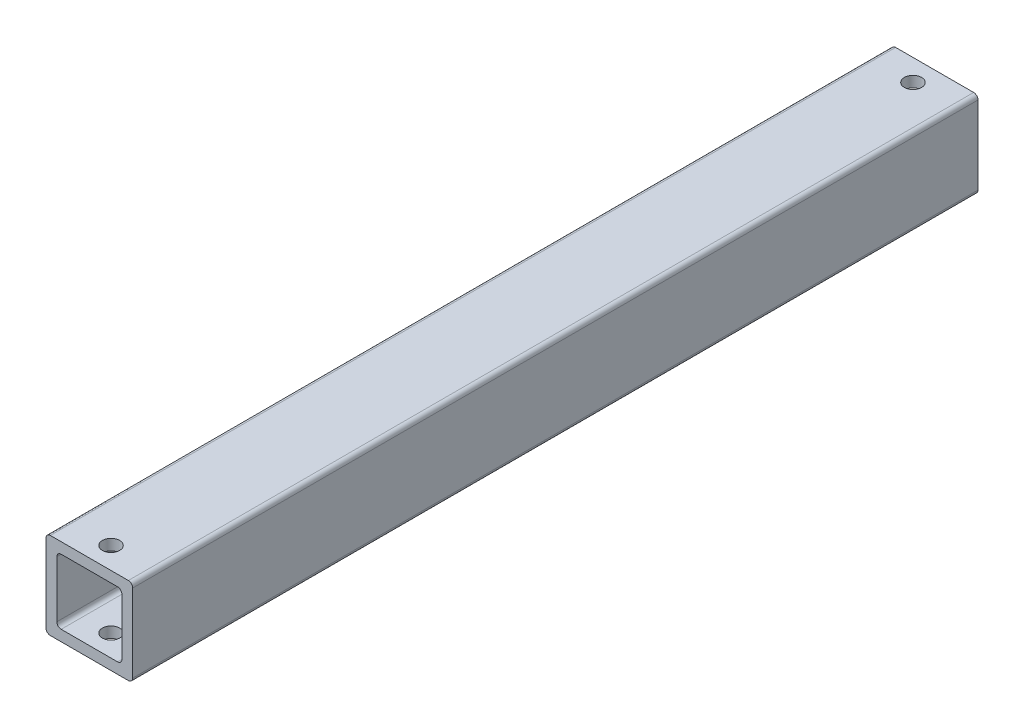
ISO-10303-21;
HEADER;
FILE_DESCRIPTION(('STEP AP214'),'2;1');
FILE_NAME('part.step','',(''),(''),'','','');
FILE_SCHEMA(('AUTOMOTIVE_DESIGN { 1 0 10303 214 1 1 1 1 }'));
ENDSEC;
DATA;
#1=APPLICATION_CONTEXT('core data for automotive mechanical design processes');
#2=APPLICATION_PROTOCOL_DEFINITION('international standard','automotive_design',2000,#1);
#3=PRODUCT_CONTEXT('',#1,'mechanical');
#4=PRODUCT('Part','Part','',(#3));
#5=PRODUCT_RELATED_PRODUCT_CATEGORY('part','',(#4));
#6=PRODUCT_DEFINITION_FORMATION('','',#4);
#7=PRODUCT_DEFINITION_CONTEXT('part definition',#1,'design');
#8=PRODUCT_DEFINITION('design','',#6,#7);
#9=PRODUCT_DEFINITION_SHAPE('','',#8);
#10=(LENGTH_UNIT() NAMED_UNIT(*) SI_UNIT(.MILLI.,.METRE.));
#11=(NAMED_UNIT(*) PLANE_ANGLE_UNIT() SI_UNIT($,.RADIAN.));
#12=(NAMED_UNIT(*) SI_UNIT($,.STERADIAN.) SOLID_ANGLE_UNIT());
#13=UNCERTAINTY_MEASURE_WITH_UNIT(LENGTH_MEASURE(1.E-05),#10,'distance_accuracy_value','');
#14=(GEOMETRIC_REPRESENTATION_CONTEXT(3) GLOBAL_UNCERTAINTY_ASSIGNED_CONTEXT((#13)) GLOBAL_UNIT_ASSIGNED_CONTEXT((#10,
#11,#12)) REPRESENTATION_CONTEXT('',''));
#15=CARTESIAN_POINT('',(0.,0.,0.));
#16=DIRECTION('',(0.,0.,1.));
#17=DIRECTION('',(1.,0.,0.));
#18=AXIS2_PLACEMENT_3D('',#15,#16,#17);
#19=CARTESIAN_POINT('',(-22.86,22.86,685.8));
#20=DIRECTION('',(0.,0.,-1.));
#21=DIRECTION('',(-1.,0.,0.));
#22=AXIS2_PLACEMENT_3D('',#19,#20,#21);
#23=CYLINDRICAL_SURFACE('',#22,2.54);
#24=CARTESIAN_POINT('',(-22.86,22.86,247.65));
#25=DIRECTION('',(0.,0.,1.));
#26=DIRECTION('',(1.,0.,0.));
#27=AXIS2_PLACEMENT_3D('',#24,#25,#26);
#28=CIRCLE('',#27,2.54);
#29=CARTESIAN_POINT('',(-22.86,25.4,247.65));
#30=VERTEX_POINT('',#29);
#31=CARTESIAN_POINT('',(-25.4,22.86,247.65));
#32=VERTEX_POINT('',#31);
#33=EDGE_CURVE('E316',#30,#32,#28,.T.);
#34=ORIENTED_EDGE('',*,*,#33,.F.);
#35=DIRECTION('',(0.,0.,-1.));
#36=VECTOR('',#35,1.);
#37=CARTESIAN_POINT('',(-22.86,25.4,685.8));
#38=LINE('',#37,#36);
#39=CARTESIAN_POINT('',(-22.86,25.4,-247.65));
#40=VERTEX_POINT('',#39);
#41=EDGE_CURVE('E176',#30,#40,#38,.T.);
#42=ORIENTED_EDGE('',*,*,#41,.T.);
#43=CARTESIAN_POINT('',(-22.86,22.86,-247.65));
#44=DIRECTION('',(0.,0.,-1.));
#45=DIRECTION('',(-1.,0.,0.));
#46=AXIS2_PLACEMENT_3D('',#43,#44,#45);
#47=CIRCLE('',#46,2.54);
#48=CARTESIAN_POINT('',(-25.4,22.86,-247.65));
#49=VERTEX_POINT('',#48);
#50=EDGE_CURVE('E211',#49,#40,#47,.T.);
#51=ORIENTED_EDGE('',*,*,#50,.F.);
#52=DIRECTION('',(0.,0.,-1.));
#53=VECTOR('',#52,1.);
#54=CARTESIAN_POINT('',(-25.4,22.86,685.8));
#55=LINE('',#54,#53);
#56=EDGE_CURVE('E190',#32,#49,#55,.T.);
#57=ORIENTED_EDGE('',*,*,#56,.F.);
#58=EDGE_LOOP('',(#34,#42,#51,#57));
#59=FACE_BOUND('',#58,.T.);
#60=ADVANCED_FACE('F32',(#59),#23,.T.);
#61=CARTESIAN_POINT('',(-25.4,-22.86,685.8));
#62=DIRECTION('',(1.,0.,0.));
#63=DIRECTION('',(0.,0.,-1.));
#64=AXIS2_PLACEMENT_3D('',#61,#62,#63);
#65=PLANE('',#64);
#66=DIRECTION('',(0.,-1.,0.));
#67=VECTOR('',#66,1.);
#68=CARTESIAN_POINT('',(-25.4,-22.86,247.65));
#69=LINE('',#68,#67);
#70=CARTESIAN_POINT('',(-25.4,-22.86,247.65));
#71=VERTEX_POINT('',#70);
#72=EDGE_CURVE('E314',#32,#71,#69,.T.);
#73=ORIENTED_EDGE('',*,*,#72,.F.);
#74=ORIENTED_EDGE('',*,*,#56,.T.);
#75=DIRECTION('',(0.,1.,0.));
#76=VECTOR('',#75,1.);
#77=CARTESIAN_POINT('',(-25.4,-22.86,-247.65));
#78=LINE('',#77,#76);
#79=CARTESIAN_POINT('',(-25.4,-22.86,-247.65));
#80=VERTEX_POINT('',#79);
#81=EDGE_CURVE('E270',#80,#49,#78,.T.);
#82=ORIENTED_EDGE('',*,*,#81,.F.);
#83=DIRECTION('',(0.,0.,-1.));
#84=VECTOR('',#83,1.);
#85=CARTESIAN_POINT('',(-25.4,-22.86,685.8));
#86=LINE('',#85,#84);
#87=EDGE_CURVE('E188',#71,#80,#86,.T.);
#88=ORIENTED_EDGE('',*,*,#87,.F.);
#89=EDGE_LOOP('',(#73,#74,#82,#88));
#90=FACE_BOUND('',#89,.T.);
#91=ADVANCED_FACE('F313',(#90),#65,.F.);
#92=CARTESIAN_POINT('',(-22.86,-22.86,685.8));
#93=DIRECTION('',(0.,0.,-1.));
#94=DIRECTION('',(-1.,0.,0.));
#95=AXIS2_PLACEMENT_3D('',#92,#93,#94);
#96=CYLINDRICAL_SURFACE('',#95,2.54);
#97=CARTESIAN_POINT('',(-22.86,-22.86,247.65));
#98=DIRECTION('',(0.,0.,1.));
#99=DIRECTION('',(1.,0.,0.));
#100=AXIS2_PLACEMENT_3D('',#97,#98,#99);
#101=CIRCLE('',#100,2.54);
#102=CARTESIAN_POINT('',(-22.86,-25.4,247.65));
#103=VERTEX_POINT('',#102);
#104=EDGE_CURVE('E309',#71,#103,#101,.T.);
#105=ORIENTED_EDGE('',*,*,#104,.F.);
#106=ORIENTED_EDGE('',*,*,#87,.T.);
#107=CARTESIAN_POINT('',(-22.86,-22.86,-247.65));
#108=DIRECTION('',(0.,0.,-1.));
#109=DIRECTION('',(-1.,0.,0.));
#110=AXIS2_PLACEMENT_3D('',#107,#108,#109);
#111=CIRCLE('',#110,2.54);
#112=CARTESIAN_POINT('',(-22.86,-25.4,-247.65));
#113=VERTEX_POINT('',#112);
#114=EDGE_CURVE('E267',#113,#80,#111,.T.);
#115=ORIENTED_EDGE('',*,*,#114,.F.);
#116=DIRECTION('',(0.,0.,-1.));
#117=VECTOR('',#116,1.);
#118=CARTESIAN_POINT('',(-22.86,-25.4,685.8));
#119=LINE('',#118,#117);
#120=EDGE_CURVE('E186',#103,#113,#119,.T.);
#121=ORIENTED_EDGE('',*,*,#120,.F.);
#122=EDGE_LOOP('',(#105,#106,#115,#121));
#123=FACE_BOUND('',#122,.T.);
#124=ADVANCED_FACE('F308',(#123),#96,.T.);
#125=CARTESIAN_POINT('',(-22.86,-25.4,685.8));
#126=DIRECTION('',(0.,1.,0.));
#127=DIRECTION('',(0.,0.,1.));
#128=AXIS2_PLACEMENT_3D('',#125,#126,#127);
#129=PLANE('',#128);
#130=CARTESIAN_POINT('',(0.,-25.4,-234.95));
#131=DIRECTION('',(0.,1.,0.));
#132=DIRECTION('',(-1.,0.,0.));
#133=AXIS2_PLACEMENT_3D('',#130,#131,#132);
#134=CIRCLE('',#133,5.07999999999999);
#135=CARTESIAN_POINT('',(-5.07999999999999,-25.4,-234.95));
#136=VERTEX_POINT('',#135);
#137=EDGE_CURVE('E199',#136,#136,#134,.T.);
#138=ORIENTED_EDGE('',*,*,#137,.T.);
#139=EDGE_LOOP('',(#138));
#140=FACE_BOUND('',#139,.T.);
#141=CARTESIAN_POINT('',(0.,-25.4,234.95));
#142=DIRECTION('',(0.,1.,0.));
#143=DIRECTION('',(-1.,0.,0.));
#144=AXIS2_PLACEMENT_3D('',#141,#142,#143);
#145=CIRCLE('',#144,5.07999999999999);
#146=CARTESIAN_POINT('',(-5.07999999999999,-25.4,234.95));
#147=VERTEX_POINT('',#146);
#148=EDGE_CURVE('E195',#147,#147,#145,.T.);
#149=ORIENTED_EDGE('',*,*,#148,.T.);
#150=EDGE_LOOP('',(#149));
#151=FACE_BOUND('',#150,.T.);
#152=DIRECTION('',(1.,0.,0.));
#153=VECTOR('',#152,1.);
#154=CARTESIAN_POINT('',(-22.86,-25.4,247.65));
#155=LINE('',#154,#153);
#156=CARTESIAN_POINT('',(22.86,-25.4,247.65));
#157=VERTEX_POINT('',#156);
#158=EDGE_CURVE('E305',#103,#157,#155,.T.);
#159=ORIENTED_EDGE('',*,*,#158,.F.);
#160=ORIENTED_EDGE('',*,*,#120,.T.);
#161=DIRECTION('',(-1.,0.,0.));
#162=VECTOR('',#161,1.);
#163=CARTESIAN_POINT('',(-22.86,-25.4,-247.65));
#164=LINE('',#163,#162);
#165=CARTESIAN_POINT('',(22.86,-25.4,-247.65));
#166=VERTEX_POINT('',#165);
#167=EDGE_CURVE('E264',#166,#113,#164,.T.);
#168=ORIENTED_EDGE('',*,*,#167,.F.);
#169=DIRECTION('',(0.,0.,-1.));
#170=VECTOR('',#169,1.);
#171=CARTESIAN_POINT('',(22.86,-25.4,685.8));
#172=LINE('',#171,#170);
#173=EDGE_CURVE('E184',#157,#166,#172,.T.);
#174=ORIENTED_EDGE('',*,*,#173,.F.);
#175=EDGE_LOOP('',(#159,#160,#168,#174));
#176=FACE_BOUND('',#175,.T.);
#177=ADVANCED_FACE('F303',(#140,#151,#176),#129,.F.);
#178=CARTESIAN_POINT('',(22.86,-22.86,685.8));
#179=DIRECTION('',(0.,0.,-1.));
#180=DIRECTION('',(-1.,0.,0.));
#181=AXIS2_PLACEMENT_3D('',#178,#179,#180);
#182=CYLINDRICAL_SURFACE('',#181,2.54);
#183=CARTESIAN_POINT('',(22.86,-22.86,247.65));
#184=DIRECTION('',(0.,0.,1.));
#185=DIRECTION('',(1.,0.,0.));
#186=AXIS2_PLACEMENT_3D('',#183,#184,#185);
#187=CIRCLE('',#186,2.54);
#188=CARTESIAN_POINT('',(25.4,-22.86,247.65));
#189=VERTEX_POINT('',#188);
#190=EDGE_CURVE('E297',#157,#189,#187,.T.);
#191=ORIENTED_EDGE('',*,*,#190,.F.);
#192=ORIENTED_EDGE('',*,*,#173,.T.);
#193=CARTESIAN_POINT('',(22.86,-22.86,-247.65));
#194=DIRECTION('',(0.,0.,-1.));
#195=DIRECTION('',(-1.,0.,0.));
#196=AXIS2_PLACEMENT_3D('',#193,#194,#195);
#197=CIRCLE('',#196,2.54);
#198=CARTESIAN_POINT('',(25.4,-22.86,-247.65));
#199=VERTEX_POINT('',#198);
#200=EDGE_CURVE('E261',#199,#166,#197,.T.);
#201=ORIENTED_EDGE('',*,*,#200,.F.);
#202=DIRECTION('',(0.,0.,-1.));
#203=VECTOR('',#202,1.);
#204=CARTESIAN_POINT('',(25.4,-22.86,685.8));
#205=LINE('',#204,#203);
#206=EDGE_CURVE('E182',#189,#199,#205,.T.);
#207=ORIENTED_EDGE('',*,*,#206,.F.);
#208=EDGE_LOOP('',(#191,#192,#201,#207));
#209=FACE_BOUND('',#208,.T.);
#210=ADVANCED_FACE('F296',(#209),#182,.T.);
#211=CARTESIAN_POINT('',(25.4,-22.86,685.8));
#212=DIRECTION('',(-1.,0.,0.));
#213=DIRECTION('',(0.,0.,1.));
#214=AXIS2_PLACEMENT_3D('',#211,#212,#213);
#215=PLANE('',#214);
#216=DIRECTION('',(0.,1.,0.));
#217=VECTOR('',#216,1.);
#218=CARTESIAN_POINT('',(25.4,-22.86,247.65));
#219=LINE('',#218,#217);
#220=CARTESIAN_POINT('',(25.4,22.86,247.65));
#221=VERTEX_POINT('',#220);
#222=EDGE_CURVE('E293',#189,#221,#219,.T.);
#223=ORIENTED_EDGE('',*,*,#222,.F.);
#224=ORIENTED_EDGE('',*,*,#206,.T.);
#225=DIRECTION('',(0.,-1.,0.));
#226=VECTOR('',#225,1.);
#227=CARTESIAN_POINT('',(25.4,-22.86,-247.65));
#228=LINE('',#227,#226);
#229=CARTESIAN_POINT('',(25.4,22.86,-247.65));
#230=VERTEX_POINT('',#229);
#231=EDGE_CURVE('E258',#230,#199,#228,.T.);
#232=ORIENTED_EDGE('',*,*,#231,.F.);
#233=DIRECTION('',(0.,0.,-1.));
#234=VECTOR('',#233,1.);
#235=CARTESIAN_POINT('',(25.4,22.86,685.8));
#236=LINE('',#235,#234);
#237=EDGE_CURVE('E180',#221,#230,#236,.T.);
#238=ORIENTED_EDGE('',*,*,#237,.F.);
#239=EDGE_LOOP('',(#223,#224,#232,#238));
#240=FACE_BOUND('',#239,.T.);
#241=ADVANCED_FACE('F291',(#240),#215,.F.);
#242=CARTESIAN_POINT('',(22.86,22.86,685.8));
#243=DIRECTION('',(0.,0.,-1.));
#244=DIRECTION('',(-1.,0.,0.));
#245=AXIS2_PLACEMENT_3D('',#242,#243,#244);
#246=CYLINDRICAL_SURFACE('',#245,2.54);
#247=CARTESIAN_POINT('',(22.86,22.86,247.65));
#248=DIRECTION('',(0.,0.,1.));
#249=DIRECTION('',(1.,0.,0.));
#250=AXIS2_PLACEMENT_3D('',#247,#248,#249);
#251=CIRCLE('',#250,2.54);
#252=CARTESIAN_POINT('',(22.86,25.4,247.65));
#253=VERTEX_POINT('',#252);
#254=EDGE_CURVE('E46',#221,#253,#251,.T.);
#255=ORIENTED_EDGE('',*,*,#254,.F.);
#256=ORIENTED_EDGE('',*,*,#237,.T.);
#257=CARTESIAN_POINT('',(22.86,22.86,-247.65));
#258=DIRECTION('',(0.,0.,-1.));
#259=DIRECTION('',(-1.,0.,0.));
#260=AXIS2_PLACEMENT_3D('',#257,#258,#259);
#261=CIRCLE('',#260,2.54);
#262=CARTESIAN_POINT('',(22.86,25.4,-247.65));
#263=VERTEX_POINT('',#262);
#264=EDGE_CURVE('E250',#263,#230,#261,.T.);
#265=ORIENTED_EDGE('',*,*,#264,.F.);
#266=DIRECTION('',(0.,0.,-1.));
#267=VECTOR('',#266,1.);
#268=CARTESIAN_POINT('',(22.86,25.4,685.8));
#269=LINE('',#268,#267);
#270=EDGE_CURVE('E178',#253,#263,#269,.T.);
#271=ORIENTED_EDGE('',*,*,#270,.F.);
#272=EDGE_LOOP('',(#255,#256,#265,#271));
#273=FACE_BOUND('',#272,.T.);
#274=ADVANCED_FACE('F285',(#273),#246,.T.);
#275=CARTESIAN_POINT('',(-22.86,25.4,685.8));
#276=DIRECTION('',(0.,-1.,0.));
#277=DIRECTION('',(1.,0.,0.));
#278=AXIS2_PLACEMENT_3D('',#275,#276,#277);
#279=PLANE('',#278);
#280=CARTESIAN_POINT('',(0.,25.4,-234.95));
#281=DIRECTION('',(0.,1.,0.));
#282=DIRECTION('',(-1.,0.,0.));
#283=AXIS2_PLACEMENT_3D('',#280,#281,#282);
#284=CIRCLE('',#283,5.07999999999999);
#285=CARTESIAN_POINT('',(-5.07999999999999,25.4,-234.95));
#286=VERTEX_POINT('',#285);
#287=EDGE_CURVE('E206',#286,#286,#284,.T.);
#288=ORIENTED_EDGE('',*,*,#287,.F.);
#289=EDGE_LOOP('',(#288));
#290=FACE_BOUND('',#289,.T.);
#291=CARTESIAN_POINT('',(0.,25.4,234.95));
#292=DIRECTION('',(0.,1.,0.));
#293=DIRECTION('',(-1.,0.,0.));
#294=AXIS2_PLACEMENT_3D('',#291,#292,#293);
#295=CIRCLE('',#294,5.07999999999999);
#296=CARTESIAN_POINT('',(-5.07999999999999,25.4,234.95));
#297=VERTEX_POINT('',#296);
#298=EDGE_CURVE('E203',#297,#297,#295,.T.);
#299=ORIENTED_EDGE('',*,*,#298,.F.);
#300=EDGE_LOOP('',(#299));
#301=FACE_BOUND('',#300,.T.);
#302=DIRECTION('',(-1.,0.,0.));
#303=VECTOR('',#302,1.);
#304=CARTESIAN_POINT('',(-22.86,25.4,247.65));
#305=LINE('',#304,#303);
#306=EDGE_CURVE('E283',#253,#30,#305,.T.);
#307=ORIENTED_EDGE('',*,*,#306,.F.);
#308=ORIENTED_EDGE('',*,*,#270,.T.);
#309=DIRECTION('',(1.,0.,0.));
#310=VECTOR('',#309,1.);
#311=CARTESIAN_POINT('',(-22.86,25.4,-247.65));
#312=LINE('',#311,#310);
#313=EDGE_CURVE('E247',#40,#263,#312,.T.);
#314=ORIENTED_EDGE('',*,*,#313,.F.);
#315=ORIENTED_EDGE('',*,*,#41,.F.);
#316=EDGE_LOOP('',(#307,#308,#314,#315));
#317=FACE_BOUND('',#316,.T.);
#318=ADVANCED_FACE('F281',(#290,#301,#317),#279,.F.);
#319=CARTESIAN_POINT('',(16.51,16.51,685.8));
#320=DIRECTION('',(0.,0.,-1.));
#321=DIRECTION('',(-1.,0.,0.));
#322=AXIS2_PLACEMENT_3D('',#319,#320,#321);
#323=CYLINDRICAL_SURFACE('',#322,2.54);
#324=DIRECTION('',(0.,0.,-1.));
#325=VECTOR('',#324,1.);
#326=CARTESIAN_POINT('',(19.05,16.51,685.8));
#327=LINE('',#326,#325);
#328=CARTESIAN_POINT('',(19.05,16.51,247.65));
#329=VERTEX_POINT('',#328);
#330=CARTESIAN_POINT('',(19.05,16.51,-247.65));
#331=VERTEX_POINT('',#330);
#332=EDGE_CURVE('E159',#329,#331,#327,.T.);
#333=ORIENTED_EDGE('',*,*,#332,.F.);
#334=CARTESIAN_POINT('',(16.51,16.51,247.65));
#335=DIRECTION('',(0.,0.,1.));
#336=DIRECTION('',(1.,0.,0.));
#337=AXIS2_PLACEMENT_3D('',#334,#335,#336);
#338=CIRCLE('',#337,2.54);
#339=CARTESIAN_POINT('',(16.51,19.05,247.65));
#340=VERTEX_POINT('',#339);
#341=EDGE_CURVE('E54',#329,#340,#338,.T.);
#342=ORIENTED_EDGE('',*,*,#341,.T.);
#343=DIRECTION('',(0.,0.,-1.));
#344=VECTOR('',#343,1.);
#345=CARTESIAN_POINT('',(16.51,19.05,685.8));
#346=LINE('',#345,#344);
#347=CARTESIAN_POINT('',(16.51,19.05,-247.65));
#348=VERTEX_POINT('',#347);
#349=EDGE_CURVE('E174',#340,#348,#346,.T.);
#350=ORIENTED_EDGE('',*,*,#349,.T.);
#351=CARTESIAN_POINT('',(16.51,16.51,-247.65));
#352=DIRECTION('',(0.,0.,-1.));
#353=DIRECTION('',(-1.,0.,0.));
#354=AXIS2_PLACEMENT_3D('',#351,#352,#353);
#355=CIRCLE('',#354,2.54);
#356=EDGE_CURVE('E241',#348,#331,#355,.T.);
#357=ORIENTED_EDGE('',*,*,#356,.T.);
#358=EDGE_LOOP('',(#333,#342,#350,#357));
#359=FACE_BOUND('',#358,.T.);
#360=ADVANCED_FACE('F228',(#359),#323,.F.);
#361=CARTESIAN_POINT('',(-16.51,19.05,685.8));
#362=DIRECTION('',(0.,-1.,0.));
#363=DIRECTION('',(0.,0.,-1.));
#364=AXIS2_PLACEMENT_3D('',#361,#362,#363);
#365=PLANE('',#364);
#366=CARTESIAN_POINT('',(0.,19.05,-234.95));
#367=DIRECTION('',(0.,-1.,0.));
#368=DIRECTION('',(0.,0.,-1.));
#369=AXIS2_PLACEMENT_3D('',#366,#367,#368);
#370=CIRCLE('',#369,5.07999999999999);
#371=CARTESIAN_POINT('',(0.,19.05,-240.03));
#372=VERTEX_POINT('',#371);
#373=EDGE_CURVE('E198',#372,#372,#370,.T.);
#374=ORIENTED_EDGE('',*,*,#373,.F.);
#375=EDGE_LOOP('',(#374));
#376=FACE_BOUND('',#375,.T.);
#377=CARTESIAN_POINT('',(0.,19.05,234.95));
#378=DIRECTION('',(0.,-1.,0.));
#379=DIRECTION('',(0.,0.,-1.));
#380=AXIS2_PLACEMENT_3D('',#377,#378,#379);
#381=CIRCLE('',#380,5.07999999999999);
#382=CARTESIAN_POINT('',(0.,19.05,229.87));
#383=VERTEX_POINT('',#382);
#384=EDGE_CURVE('E163',#383,#383,#381,.T.);
#385=ORIENTED_EDGE('',*,*,#384,.F.);
#386=EDGE_LOOP('',(#385));
#387=FACE_BOUND('',#386,.T.);
#388=ORIENTED_EDGE('',*,*,#349,.F.);
#389=DIRECTION('',(-1.,0.,0.));
#390=VECTOR('',#389,1.);
#391=CARTESIAN_POINT('',(-16.51,19.05,247.65));
#392=LINE('',#391,#390);
#393=CARTESIAN_POINT('',(-16.51,19.05,247.65));
#394=VERTEX_POINT('',#393);
#395=EDGE_CURVE('E234',#340,#394,#392,.T.);
#396=ORIENTED_EDGE('',*,*,#395,.T.);
#397=DIRECTION('',(0.,0.,-1.));
#398=VECTOR('',#397,1.);
#399=CARTESIAN_POINT('',(-16.51,19.05,685.8));
#400=LINE('',#399,#398);
#401=CARTESIAN_POINT('',(-16.51,19.05,-247.65));
#402=VERTEX_POINT('',#401);
#403=EDGE_CURVE('E172',#394,#402,#400,.T.);
#404=ORIENTED_EDGE('',*,*,#403,.T.);
#405=DIRECTION('',(1.,0.,0.));
#406=VECTOR('',#405,1.);
#407=CARTESIAN_POINT('',(-16.51,19.05,-247.65));
#408=LINE('',#407,#406);
#409=EDGE_CURVE('E237',#402,#348,#408,.T.);
#410=ORIENTED_EDGE('',*,*,#409,.T.);
#411=EDGE_LOOP('',(#388,#396,#404,#410));
#412=FACE_BOUND('',#411,.T.);
#413=ADVANCED_FACE('F224',(#376,#387,#412),#365,.T.);
#414=CARTESIAN_POINT('',(-16.51,16.51,685.8));
#415=DIRECTION('',(0.,0.,-1.));
#416=DIRECTION('',(-1.,0.,0.));
#417=AXIS2_PLACEMENT_3D('',#414,#415,#416);
#418=CYLINDRICAL_SURFACE('',#417,2.54);
#419=ORIENTED_EDGE('',*,*,#403,.F.);
#420=CARTESIAN_POINT('',(-16.51,16.51,247.65));
#421=DIRECTION('',(0.,0.,1.));
#422=DIRECTION('',(1.,0.,0.));
#423=AXIS2_PLACEMENT_3D('',#420,#421,#422);
#424=CIRCLE('',#423,2.54);
#425=CARTESIAN_POINT('',(-19.05,16.51,247.65));
#426=VERTEX_POINT('',#425);
#427=EDGE_CURVE('E353',#394,#426,#424,.T.);
#428=ORIENTED_EDGE('',*,*,#427,.T.);
#429=DIRECTION('',(0.,0.,-1.));
#430=VECTOR('',#429,1.);
#431=CARTESIAN_POINT('',(-19.05,16.51,685.8));
#432=LINE('',#431,#430);
#433=CARTESIAN_POINT('',(-19.05,16.51,-247.65));
#434=VERTEX_POINT('',#433);
#435=EDGE_CURVE('E170',#426,#434,#432,.T.);
#436=ORIENTED_EDGE('',*,*,#435,.T.);
#437=CARTESIAN_POINT('',(-16.51,16.51,-247.65));
#438=DIRECTION('',(0.,0.,-1.));
#439=DIRECTION('',(-1.,0.,0.));
#440=AXIS2_PLACEMENT_3D('',#437,#438,#439);
#441=CIRCLE('',#440,2.54);
#442=EDGE_CURVE('E252',#434,#402,#441,.T.);
#443=ORIENTED_EDGE('',*,*,#442,.T.);
#444=EDGE_LOOP('',(#419,#428,#436,#443));
#445=FACE_BOUND('',#444,.T.);
#446=ADVANCED_FACE('F227',(#445),#418,.F.);
#447=CARTESIAN_POINT('',(-19.05,-16.51,685.8));
#448=DIRECTION('',(1.,0.,0.));
#449=DIRECTION('',(0.,0.,-1.));
#450=AXIS2_PLACEMENT_3D('',#447,#448,#449);
#451=PLANE('',#450);
#452=ORIENTED_EDGE('',*,*,#435,.F.);
#453=DIRECTION('',(0.,-1.,0.));
#454=VECTOR('',#453,1.);
#455=CARTESIAN_POINT('',(-19.05,-16.51,247.65));
#456=LINE('',#455,#454);
#457=CARTESIAN_POINT('',(-19.05,-16.51,247.65));
#458=VERTEX_POINT('',#457);
#459=EDGE_CURVE('E340',#426,#458,#456,.T.);
#460=ORIENTED_EDGE('',*,*,#459,.T.);
#461=DIRECTION('',(0.,0.,-1.));
#462=VECTOR('',#461,1.);
#463=CARTESIAN_POINT('',(-19.05,-16.51,685.8));
#464=LINE('',#463,#462);
#465=CARTESIAN_POINT('',(-19.05,-16.51,-247.65));
#466=VERTEX_POINT('',#465);
#467=EDGE_CURVE('E168',#458,#466,#464,.T.);
#468=ORIENTED_EDGE('',*,*,#467,.T.);
#469=DIRECTION('',(0.,1.,0.));
#470=VECTOR('',#469,1.);
#471=CARTESIAN_POINT('',(-19.05,-16.51,-247.65));
#472=LINE('',#471,#470);
#473=EDGE_CURVE('E329',#466,#434,#472,.T.);
#474=ORIENTED_EDGE('',*,*,#473,.T.);
#475=EDGE_LOOP('',(#452,#460,#468,#474));
#476=FACE_BOUND('',#475,.T.);
#477=ADVANCED_FACE('F337',(#476),#451,.T.);
#478=CARTESIAN_POINT('',(-16.51,-16.51,685.8));
#479=DIRECTION('',(0.,0.,-1.));
#480=DIRECTION('',(-1.,0.,0.));
#481=AXIS2_PLACEMENT_3D('',#478,#479,#480);
#482=CYLINDRICAL_SURFACE('',#481,2.54);
#483=ORIENTED_EDGE('',*,*,#467,.F.);
#484=CARTESIAN_POINT('',(-16.51,-16.51,247.65));
#485=DIRECTION('',(0.,0.,1.));
#486=DIRECTION('',(1.,0.,0.));
#487=AXIS2_PLACEMENT_3D('',#484,#485,#486);
#488=CIRCLE('',#487,2.54);
#489=CARTESIAN_POINT('',(-16.51,-19.05,247.65));
#490=VERTEX_POINT('',#489);
#491=EDGE_CURVE('E344',#458,#490,#488,.T.);
#492=ORIENTED_EDGE('',*,*,#491,.T.);
#493=DIRECTION('',(0.,0.,-1.));
#494=VECTOR('',#493,1.);
#495=CARTESIAN_POINT('',(-16.51,-19.05,685.8));
#496=LINE('',#495,#494);
#497=CARTESIAN_POINT('',(-16.51,-19.05,-247.65));
#498=VERTEX_POINT('',#497);
#499=EDGE_CURVE('E161',#490,#498,#496,.T.);
#500=ORIENTED_EDGE('',*,*,#499,.T.);
#501=CARTESIAN_POINT('',(-16.51,-16.51,-247.65));
#502=DIRECTION('',(0.,0.,-1.));
#503=DIRECTION('',(-1.,0.,0.));
#504=AXIS2_PLACEMENT_3D('',#501,#502,#503);
#505=CIRCLE('',#504,2.54);
#506=EDGE_CURVE('E326',#498,#466,#505,.T.);
#507=ORIENTED_EDGE('',*,*,#506,.T.);
#508=EDGE_LOOP('',(#483,#492,#500,#507));
#509=FACE_BOUND('',#508,.T.);
#510=ADVANCED_FACE('F343',(#509),#482,.F.);
#511=CARTESIAN_POINT('',(-16.51,-19.05,685.8));
#512=DIRECTION('',(0.,1.,0.));
#513=DIRECTION('',(0.,0.,1.));
#514=AXIS2_PLACEMENT_3D('',#511,#512,#513);
#515=PLANE('',#514);
#516=CARTESIAN_POINT('',(0.,-19.05,-234.95));
#517=DIRECTION('',(0.,1.,0.));
#518=DIRECTION('',(0.,0.,1.));
#519=AXIS2_PLACEMENT_3D('',#516,#517,#518);
#520=CIRCLE('',#519,5.07999999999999);
#521=CARTESIAN_POINT('',(0.,-19.05,-229.87));
#522=VERTEX_POINT('',#521);
#523=EDGE_CURVE('E196',#522,#522,#520,.T.);
#524=ORIENTED_EDGE('',*,*,#523,.F.);
#525=EDGE_LOOP('',(#524));
#526=FACE_BOUND('',#525,.T.);
#527=CARTESIAN_POINT('',(0.,-19.05,234.95));
#528=DIRECTION('',(0.,1.,0.));
#529=DIRECTION('',(0.,0.,1.));
#530=AXIS2_PLACEMENT_3D('',#527,#528,#529);
#531=CIRCLE('',#530,5.07999999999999);
#532=CARTESIAN_POINT('',(0.,-19.05,240.03));
#533=VERTEX_POINT('',#532);
#534=EDGE_CURVE('E192',#533,#533,#531,.T.);
#535=ORIENTED_EDGE('',*,*,#534,.F.);
#536=EDGE_LOOP('',(#535));
#537=FACE_BOUND('',#536,.T.);
#538=ORIENTED_EDGE('',*,*,#499,.F.);
#539=DIRECTION('',(1.,0.,0.));
#540=VECTOR('',#539,1.);
#541=CARTESIAN_POINT('',(-16.51,-19.05,247.65));
#542=LINE('',#541,#540);
#543=CARTESIAN_POINT('',(16.51,-19.05,247.65));
#544=VERTEX_POINT('',#543);
#545=EDGE_CURVE('E154',#490,#544,#542,.T.);
#546=ORIENTED_EDGE('',*,*,#545,.T.);
#547=DIRECTION('',(0.,0.,-1.));
#548=VECTOR('',#547,1.);
#549=CARTESIAN_POINT('',(16.51,-19.05,685.8));
#550=LINE('',#549,#548);
#551=CARTESIAN_POINT('',(16.51,-19.05,-247.65));
#552=VERTEX_POINT('',#551);
#553=EDGE_CURVE('E153',#544,#552,#550,.T.);
#554=ORIENTED_EDGE('',*,*,#553,.T.);
#555=DIRECTION('',(-1.,0.,0.));
#556=VECTOR('',#555,1.);
#557=CARTESIAN_POINT('',(-16.51,-19.05,-247.65));
#558=LINE('',#557,#556);
#559=EDGE_CURVE('E319',#552,#498,#558,.T.);
#560=ORIENTED_EDGE('',*,*,#559,.T.);
#561=EDGE_LOOP('',(#538,#546,#554,#560));
#562=FACE_BOUND('',#561,.T.);
#563=ADVANCED_FACE('F348',(#526,#537,#562),#515,.T.);
#564=CARTESIAN_POINT('',(16.51,-16.51,685.8));
#565=DIRECTION('',(0.,0.,-1.));
#566=DIRECTION('',(-1.,0.,0.));
#567=AXIS2_PLACEMENT_3D('',#564,#565,#566);
#568=CYLINDRICAL_SURFACE('',#567,2.54);
#569=ORIENTED_EDGE('',*,*,#553,.F.);
#570=CARTESIAN_POINT('',(16.51,-16.51,247.65));
#571=DIRECTION('',(0.,0.,1.));
#572=DIRECTION('',(1.,0.,0.));
#573=AXIS2_PLACEMENT_3D('',#570,#571,#572);
#574=CIRCLE('',#573,2.54);
#575=CARTESIAN_POINT('',(19.05,-16.51,247.65));
#576=VERTEX_POINT('',#575);
#577=EDGE_CURVE('E142',#544,#576,#574,.T.);
#578=ORIENTED_EDGE('',*,*,#577,.T.);
#579=DIRECTION('',(0.,0.,-1.));
#580=VECTOR('',#579,1.);
#581=CARTESIAN_POINT('',(19.05,-16.51,685.8));
#582=LINE('',#581,#580);
#583=CARTESIAN_POINT('',(19.05,-16.51,-247.65));
#584=VERTEX_POINT('',#583);
#585=EDGE_CURVE('E151',#576,#584,#582,.T.);
#586=ORIENTED_EDGE('',*,*,#585,.T.);
#587=CARTESIAN_POINT('',(16.51,-16.51,-247.65));
#588=DIRECTION('',(0.,0.,-1.));
#589=DIRECTION('',(-1.,0.,0.));
#590=AXIS2_PLACEMENT_3D('',#587,#588,#589);
#591=CIRCLE('',#590,2.54);
#592=EDGE_CURVE('E317',#584,#552,#591,.T.);
#593=ORIENTED_EDGE('',*,*,#592,.T.);
#594=EDGE_LOOP('',(#569,#578,#586,#593));
#595=FACE_BOUND('',#594,.T.);
#596=ADVANCED_FACE('F149',(#595),#568,.F.);
#597=CARTESIAN_POINT('',(19.05,-16.51,685.8));
#598=DIRECTION('',(-1.,0.,0.));
#599=DIRECTION('',(0.,0.,1.));
#600=AXIS2_PLACEMENT_3D('',#597,#598,#599);
#601=PLANE('',#600);
#602=ORIENTED_EDGE('',*,*,#585,.F.);
#603=DIRECTION('',(0.,1.,0.));
#604=VECTOR('',#603,1.);
#605=CARTESIAN_POINT('',(19.05,-16.51,247.65));
#606=LINE('',#605,#604);
#607=EDGE_CURVE('E11',#576,#329,#606,.T.);
#608=ORIENTED_EDGE('',*,*,#607,.T.);
#609=ORIENTED_EDGE('',*,*,#332,.T.);
#610=DIRECTION('',(0.,-1.,0.));
#611=VECTOR('',#610,1.);
#612=CARTESIAN_POINT('',(19.05,-16.51,-247.65));
#613=LINE('',#612,#611);
#614=EDGE_CURVE('E39',#331,#584,#613,.T.);
#615=ORIENTED_EDGE('',*,*,#614,.T.);
#616=EDGE_LOOP('',(#602,#608,#609,#615));
#617=FACE_BOUND('',#616,.T.);
#618=ADVANCED_FACE('F157',(#617),#601,.T.);
#619=CARTESIAN_POINT('',(0.,-25.4,234.95));
#620=DIRECTION('',(0.,1.,0.));
#621=DIRECTION('',(-1.,0.,0.));
#622=AXIS2_PLACEMENT_3D('',#619,#620,#621);
#623=CYLINDRICAL_SURFACE('',#622,5.07999999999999);
#624=ORIENTED_EDGE('',*,*,#534,.T.);
#625=EDGE_LOOP('',(#624));
#626=FACE_BOUND('',#625,.T.);
#627=ORIENTED_EDGE('',*,*,#148,.F.);
#628=EDGE_LOOP('',(#627));
#629=FACE_BOUND('',#628,.T.);
#630=ADVANCED_FACE('F403',(#626,#629),#623,.F.);
#631=ORIENTED_EDGE('',*,*,#384,.T.);
#632=EDGE_LOOP('',(#631));
#633=FACE_BOUND('',#632,.T.);
#634=ORIENTED_EDGE('',*,*,#298,.T.);
#635=EDGE_LOOP('',(#634));
#636=FACE_BOUND('',#635,.T.);
#637=ADVANCED_FACE('F221',(#633,#636),#623,.F.);
#638=CARTESIAN_POINT('',(0.,-25.4,-234.95));
#639=DIRECTION('',(0.,1.,0.));
#640=DIRECTION('',(-1.,0.,0.));
#641=AXIS2_PLACEMENT_3D('',#638,#639,#640);
#642=CYLINDRICAL_SURFACE('',#641,5.07999999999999);
#643=ORIENTED_EDGE('',*,*,#523,.T.);
#644=EDGE_LOOP('',(#643));
#645=FACE_BOUND('',#644,.T.);
#646=ORIENTED_EDGE('',*,*,#137,.F.);
#647=EDGE_LOOP('',(#646));
#648=FACE_BOUND('',#647,.T.);
#649=ADVANCED_FACE('F407',(#645,#648),#642,.F.);
#650=ORIENTED_EDGE('',*,*,#373,.T.);
#651=EDGE_LOOP('',(#650));
#652=FACE_BOUND('',#651,.T.);
#653=ORIENTED_EDGE('',*,*,#287,.T.);
#654=EDGE_LOOP('',(#653));
#655=FACE_BOUND('',#654,.T.);
#656=ADVANCED_FACE('F366',(#652,#655),#642,.F.);
#657=CARTESIAN_POINT('',(28.1546690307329,-28.4849290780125,-247.65));
#658=DIRECTION('',(0.,0.,-1.));
#659=DIRECTION('',(-1.,0.,0.));
#660=AXIS2_PLACEMENT_3D('',#657,#658,#659);
#661=PLANE('',#660);
#662=ORIENTED_EDGE('',*,*,#409,.F.);
#663=ORIENTED_EDGE('',*,*,#442,.F.);
#664=ORIENTED_EDGE('',*,*,#473,.F.);
#665=ORIENTED_EDGE('',*,*,#506,.F.);
#666=ORIENTED_EDGE('',*,*,#559,.F.);
#667=ORIENTED_EDGE('',*,*,#592,.F.);
#668=ORIENTED_EDGE('',*,*,#614,.F.);
#669=ORIENTED_EDGE('',*,*,#356,.F.);
#670=EDGE_LOOP('',(#662,#663,#664,#665,#666,#667,#668,#669));
#671=FACE_BOUND('',#670,.T.);
#672=ORIENTED_EDGE('',*,*,#50,.T.);
#673=ORIENTED_EDGE('',*,*,#313,.T.);
#674=ORIENTED_EDGE('',*,*,#264,.T.);
#675=ORIENTED_EDGE('',*,*,#231,.T.);
#676=ORIENTED_EDGE('',*,*,#200,.T.);
#677=ORIENTED_EDGE('',*,*,#167,.T.);
#678=ORIENTED_EDGE('',*,*,#114,.T.);
#679=ORIENTED_EDGE('',*,*,#81,.T.);
#680=EDGE_LOOP('',(#672,#673,#674,#675,#676,#677,#678,#679));
#681=FACE_BOUND('',#680,.T.);
#682=ADVANCED_FACE('F243',(#671,#681),#661,.T.);
#683=CARTESIAN_POINT('',(-32.3097960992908,-37.9995715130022,247.65));
#684=DIRECTION('',(0.,0.,1.));
#685=DIRECTION('',(1.,0.,0.));
#686=AXIS2_PLACEMENT_3D('',#683,#684,#685);
#687=PLANE('',#686);
#688=ORIENTED_EDGE('',*,*,#607,.F.);
#689=ORIENTED_EDGE('',*,*,#577,.F.);
#690=ORIENTED_EDGE('',*,*,#545,.F.);
#691=ORIENTED_EDGE('',*,*,#491,.F.);
#692=ORIENTED_EDGE('',*,*,#459,.F.);
#693=ORIENTED_EDGE('',*,*,#427,.F.);
#694=ORIENTED_EDGE('',*,*,#395,.F.);
#695=ORIENTED_EDGE('',*,*,#341,.F.);
#696=EDGE_LOOP('',(#688,#689,#690,#691,#692,#693,#694,#695));
#697=FACE_BOUND('',#696,.T.);
#698=ORIENTED_EDGE('',*,*,#33,.T.);
#699=ORIENTED_EDGE('',*,*,#72,.T.);
#700=ORIENTED_EDGE('',*,*,#104,.T.);
#701=ORIENTED_EDGE('',*,*,#158,.T.);
#702=ORIENTED_EDGE('',*,*,#190,.T.);
#703=ORIENTED_EDGE('',*,*,#222,.T.);
#704=ORIENTED_EDGE('',*,*,#254,.T.);
#705=ORIENTED_EDGE('',*,*,#306,.T.);
#706=EDGE_LOOP('',(#698,#699,#700,#701,#702,#703,#704,#705));
#707=FACE_BOUND('',#706,.T.);
#708=ADVANCED_FACE('F141',(#697,#707),#687,.T.);
#709=CLOSED_SHELL('',(#60,#91,#124,#177,#210,#241,#274,#318,#360,#413,#446,#477,#510,#563,#596,
#618,#630,#637,#649,#656,#682,#708));
#710=MANIFOLD_SOLID_BREP('B2',#709);
#711=ADVANCED_BREP_SHAPE_REPRESENTATION('',(#18,#710),#14);
#712=SHAPE_DEFINITION_REPRESENTATION(#9,#711);
ENDSEC;
END-ISO-10303-21;
